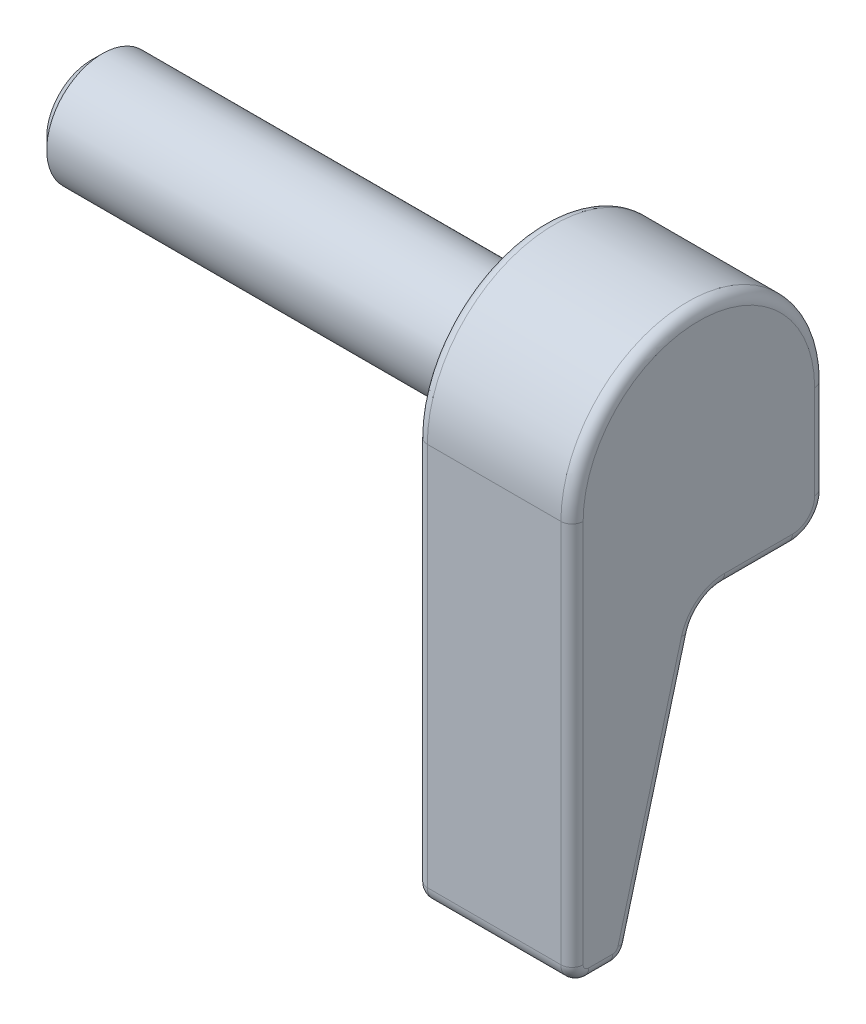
ISO-10303-21;
HEADER;
FILE_DESCRIPTION(('STEP AP214'),'2;1');
FILE_NAME('part.step','',(''),(''),'','','');
FILE_SCHEMA(('AUTOMOTIVE_DESIGN { 1 0 10303 214 1 1 1 1 }'));
ENDSEC;
DATA;
#1=APPLICATION_CONTEXT('core data for automotive mechanical design processes');
#2=APPLICATION_PROTOCOL_DEFINITION('international standard','automotive_design',2000,#1);
#3=PRODUCT_CONTEXT('',#1,'mechanical');
#4=PRODUCT('Part','Part','',(#3));
#5=PRODUCT_RELATED_PRODUCT_CATEGORY('part','',(#4));
#6=PRODUCT_DEFINITION_FORMATION('','',#4);
#7=PRODUCT_DEFINITION_CONTEXT('part definition',#1,'design');
#8=PRODUCT_DEFINITION('design','',#6,#7);
#9=PRODUCT_DEFINITION_SHAPE('','',#8);
#10=(LENGTH_UNIT() NAMED_UNIT(*) SI_UNIT(.MILLI.,.METRE.));
#11=(NAMED_UNIT(*) PLANE_ANGLE_UNIT() SI_UNIT($,.RADIAN.));
#12=(NAMED_UNIT(*) SI_UNIT($,.STERADIAN.) SOLID_ANGLE_UNIT());
#13=UNCERTAINTY_MEASURE_WITH_UNIT(LENGTH_MEASURE(1.E-05),#10,'distance_accuracy_value','');
#14=(GEOMETRIC_REPRESENTATION_CONTEXT(3) GLOBAL_UNCERTAINTY_ASSIGNED_CONTEXT((#13)) GLOBAL_UNIT_ASSIGNED_CONTEXT((#10,
#11,#12)) REPRESENTATION_CONTEXT('',''));
#15=CARTESIAN_POINT('',(0.,0.,0.));
#16=DIRECTION('',(0.,0.,1.));
#17=DIRECTION('',(1.,0.,0.));
#18=AXIS2_PLACEMENT_3D('',#15,#16,#17);
#19=CARTESIAN_POINT('',(40.,0.,0.));
#20=DIRECTION('',(-1.,0.,0.));
#21=DIRECTION('',(0.,0.,1.));
#22=AXIS2_PLACEMENT_3D('',#19,#20,#21);
#23=CYLINDRICAL_SURFACE('',#22,5.);
#24=CARTESIAN_POINT('',(39.75,0.,0.));
#25=DIRECTION('',(1.,0.,0.));
#26=DIRECTION('',(0.,0.,-1.));
#27=AXIS2_PLACEMENT_3D('',#24,#25,#26);
#28=CIRCLE('',#27,5.);
#29=CARTESIAN_POINT('',(39.75,0.,-5.));
#30=VERTEX_POINT('',#29);
#31=EDGE_CURVE('E11',#30,#30,#28,.F.);
#32=ORIENTED_EDGE('',*,*,#31,.T.);
#33=EDGE_LOOP('',(#32));
#34=FACE_BOUND('',#33,.T.);
#35=CARTESIAN_POINT('',(1.,0.,0.));
#36=DIRECTION('',(1.,0.,0.));
#37=DIRECTION('',(0.,0.,-1.));
#38=AXIS2_PLACEMENT_3D('',#35,#36,#37);
#39=CIRCLE('',#38,5.);
#40=CARTESIAN_POINT('',(1.,0.,-5.));
#41=VERTEX_POINT('',#40);
#42=EDGE_CURVE('E179',#41,#41,#39,.T.);
#43=ORIENTED_EDGE('',*,*,#42,.T.);
#44=EDGE_LOOP('',(#43));
#45=FACE_BOUND('',#44,.T.);
#46=ADVANCED_FACE('F31',(#34,#45),#23,.T.);
#47=CARTESIAN_POINT('',(0.,0.,0.));
#48=DIRECTION('',(1.,0.,0.));
#49=DIRECTION('',(0.,0.,-1.));
#50=AXIS2_PLACEMENT_3D('',#47,#48,#49);
#51=PLANE('',#50);
#52=CARTESIAN_POINT('',(0.,0.,0.));
#53=DIRECTION('',(1.,0.,0.));
#54=DIRECTION('',(0.,0.,-1.));
#55=AXIS2_PLACEMENT_3D('',#52,#53,#54);
#56=CIRCLE('',#55,3.99999999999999);
#57=CARTESIAN_POINT('',(0.,0.,-3.99999999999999));
#58=VERTEX_POINT('',#57);
#59=EDGE_CURVE('E333',#58,#58,#56,.F.);
#60=ORIENTED_EDGE('',*,*,#59,.T.);
#61=EDGE_LOOP('',(#60));
#62=FACE_BOUND('',#61,.T.);
#63=ADVANCED_FACE('F351',(#62),#51,.F.);
#64=CARTESIAN_POINT('',(40.,0.,-0.600000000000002));
#65=DIRECTION('',(1.,0.,0.));
#66=DIRECTION('',(0.,0.,-1.));
#67=AXIS2_PLACEMENT_3D('',#64,#65,#66);
#68=PLANE('',#67);
#69=CARTESIAN_POINT('',(40.,0.,0.));
#70=DIRECTION('',(1.,0.,0.));
#71=DIRECTION('',(0.,0.,-1.));
#72=AXIS2_PLACEMENT_3D('',#69,#70,#71);
#73=CIRCLE('',#72,5.24999999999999);
#74=CARTESIAN_POINT('',(40.,0.,-5.24999999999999));
#75=VERTEX_POINT('',#74);
#76=EDGE_CURVE('E39',#75,#75,#73,.T.);
#77=ORIENTED_EDGE('',*,*,#76,.T.);
#78=EDGE_LOOP('',(#77));
#79=FACE_BOUND('',#78,.T.);
#80=DIRECTION('',(0.,-1.,0.));
#81=VECTOR('',#80,1.);
#82=CARTESIAN_POINT('',(40.,0.,9.8));
#83=LINE('',#82,#81);
#84=CARTESIAN_POINT('',(40.,-34.5,9.8));
#85=VERTEX_POINT('',#84);
#86=CARTESIAN_POINT('',(40.,0.,9.8));
#87=VERTEX_POINT('',#86);
#88=EDGE_CURVE('E206',#85,#87,#83,.F.);
#89=ORIENTED_EDGE('',*,*,#88,.T.);
#90=CARTESIAN_POINT('',(40.,0.,-0.600000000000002));
#91=DIRECTION('',(1.,0.,0.));
#92=DIRECTION('',(0.,0.,-1.));
#93=AXIS2_PLACEMENT_3D('',#90,#91,#92);
#94=CIRCLE('',#93,10.4);
#95=CARTESIAN_POINT('',(40.,0.,-11.));
#96=VERTEX_POINT('',#95);
#97=EDGE_CURVE('E227',#87,#96,#94,.F.);
#98=ORIENTED_EDGE('',*,*,#97,.T.);
#99=DIRECTION('',(0.,1.,0.));
#100=VECTOR('',#99,1.);
#101=CARTESIAN_POINT('',(40.,0.,-11.));
#102=LINE('',#101,#100);
#103=CARTESIAN_POINT('',(40.,-8.4,-11.));
#104=VERTEX_POINT('',#103);
#105=EDGE_CURVE('E225',#96,#104,#102,.F.);
#106=ORIENTED_EDGE('',*,*,#105,.T.);
#107=CARTESIAN_POINT('',(40.,-8.4,-9.));
#108=DIRECTION('',(1.,0.,0.));
#109=DIRECTION('',(0.,0.,-1.));
#110=AXIS2_PLACEMENT_3D('',#107,#108,#109);
#111=CIRCLE('',#110,2.);
#112=CARTESIAN_POINT('',(40.,-10.4,-9.));
#113=VERTEX_POINT('',#112);
#114=EDGE_CURVE('E223',#104,#113,#111,.F.);
#115=ORIENTED_EDGE('',*,*,#114,.T.);
#116=DIRECTION('',(0.,0.,-1.));
#117=VECTOR('',#116,1.);
#118=CARTESIAN_POINT('',(40.,-10.4,-0.600000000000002));
#119=LINE('',#118,#117);
#120=CARTESIAN_POINT('',(40.,-10.4,-2.90121735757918));
#121=VERTEX_POINT('',#120);
#122=EDGE_CURVE('E221',#113,#121,#119,.F.);
#123=ORIENTED_EDGE('',*,*,#122,.T.);
#124=CARTESIAN_POINT('',(40.,-14.4,-2.90121735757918));
#125=DIRECTION('',(1.,0.,0.));
#126=DIRECTION('',(0.,0.,-1.));
#127=AXIS2_PLACEMENT_3D('',#124,#125,#126);
#128=CIRCLE('',#127,4.);
#129=CARTESIAN_POINT('',(40.,-13.3634857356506,0.962153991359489));
#130=VERTEX_POINT('',#129);
#131=EDGE_CURVE('E219',#121,#130,#128,.T.);
#132=ORIENTED_EDGE('',*,*,#131,.T.);
#133=DIRECTION('',(0.,0.965842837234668,-0.25912856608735));
#134=VECTOR('',#133,1.);
#135=CARTESIAN_POINT('',(40.,-0.506354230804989,-2.4873203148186));
#136=LINE('',#135,#134);
#137=CARTESIAN_POINT('',(40.,-34.6295642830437,6.66768726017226));
#138=VERTEX_POINT('',#137);
#139=EDGE_CURVE('E217',#130,#138,#136,.F.);
#140=ORIENTED_EDGE('',*,*,#139,.T.);
#141=CARTESIAN_POINT('',(40.,-34.5,7.15060867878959));
#142=DIRECTION('',(1.,0.,0.));
#143=DIRECTION('',(0.,0.,-1.));
#144=AXIS2_PLACEMENT_3D('',#141,#142,#143);
#145=CIRCLE('',#144,0.500000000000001);
#146=CARTESIAN_POINT('',(40.,-35.,7.15060867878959));
#147=VERTEX_POINT('',#146);
#148=EDGE_CURVE('E215',#138,#147,#145,.F.);
#149=ORIENTED_EDGE('',*,*,#148,.T.);
#150=DIRECTION('',(0.,0.,-1.));
#151=VECTOR('',#150,1.);
#152=CARTESIAN_POINT('',(40.,-35.,-0.600000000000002));
#153=LINE('',#152,#151);
#154=CARTESIAN_POINT('',(40.,-35.,9.3));
#155=VERTEX_POINT('',#154);
#156=EDGE_CURVE('E213',#147,#155,#153,.F.);
#157=ORIENTED_EDGE('',*,*,#156,.T.);
#158=CARTESIAN_POINT('',(40.,-34.5,9.3));
#159=DIRECTION('',(1.,0.,0.));
#160=DIRECTION('',(0.,0.,-1.));
#161=AXIS2_PLACEMENT_3D('',#158,#159,#160);
#162=CIRCLE('',#161,0.500000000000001);
#163=EDGE_CURVE('E211',#155,#85,#162,.F.);
#164=ORIENTED_EDGE('',*,*,#163,.T.);
#165=EDGE_LOOP('',(#89,#98,#106,#115,#123,#132,#140,#149,#157,#164));
#166=FACE_BOUND('',#165,.T.);
#167=ADVANCED_FACE('F338',(#79,#166),#68,.F.);
#168=CARTESIAN_POINT('',(54.,0.,-0.600000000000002));
#169=DIRECTION('',(-1.,0.,0.));
#170=DIRECTION('',(0.,0.,1.));
#171=AXIS2_PLACEMENT_3D('',#168,#169,#170);
#172=CYLINDRICAL_SURFACE('',#171,11.4);
#173=DIRECTION('',(-1.,0.,0.));
#174=VECTOR('',#173,1.);
#175=CARTESIAN_POINT('',(54.,0.,-12.));
#176=LINE('',#175,#174);
#177=CARTESIAN_POINT('',(53.,0.,-12.));
#178=VERTEX_POINT('',#177);
#179=CARTESIAN_POINT('',(41.,0.,-12.));
#180=VERTEX_POINT('',#179);
#181=EDGE_CURVE('E310',#178,#180,#176,.T.);
#182=ORIENTED_EDGE('',*,*,#181,.T.);
#183=CARTESIAN_POINT('',(41.,0.,-0.600000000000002));
#184=DIRECTION('',(1.,0.,0.));
#185=DIRECTION('',(0.,0.,-1.));
#186=AXIS2_PLACEMENT_3D('',#183,#184,#185);
#187=CIRCLE('',#186,11.4);
#188=CARTESIAN_POINT('',(41.,0.,10.8));
#189=VERTEX_POINT('',#188);
#190=EDGE_CURVE('E190',#180,#189,#187,.T.);
#191=ORIENTED_EDGE('',*,*,#190,.T.);
#192=DIRECTION('',(-1.,0.,0.));
#193=VECTOR('',#192,1.);
#194=CARTESIAN_POINT('',(54.,0.,10.8));
#195=LINE('',#194,#193);
#196=CARTESIAN_POINT('',(53.,0.,10.8));
#197=VERTEX_POINT('',#196);
#198=EDGE_CURVE('E172',#197,#189,#195,.T.);
#199=ORIENTED_EDGE('',*,*,#198,.F.);
#200=CARTESIAN_POINT('',(53.,0.,-0.600000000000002));
#201=DIRECTION('',(1.,0.,0.));
#202=DIRECTION('',(0.,0.,-1.));
#203=AXIS2_PLACEMENT_3D('',#200,#201,#202);
#204=CIRCLE('',#203,11.4);
#205=EDGE_CURVE('E187',#197,#178,#204,.F.);
#206=ORIENTED_EDGE('',*,*,#205,.T.);
#207=EDGE_LOOP('',(#182,#191,#199,#206));
#208=FACE_BOUND('',#207,.T.);
#209=ADVANCED_FACE('F185',(#208),#172,.T.);
#210=CARTESIAN_POINT('',(54.,0.,10.8));
#211=DIRECTION('',(0.,0.,-1.));
#212=DIRECTION('',(0.,1.,0.));
#213=AXIS2_PLACEMENT_3D('',#210,#211,#212);
#214=PLANE('',#213);
#215=DIRECTION('',(-1.,0.,0.));
#216=VECTOR('',#215,1.);
#217=CARTESIAN_POINT('',(54.,-34.5,10.8));
#218=LINE('',#217,#216);
#219=CARTESIAN_POINT('',(53.,-34.5,10.8));
#220=VERTEX_POINT('',#219);
#221=CARTESIAN_POINT('',(41.,-34.5,10.8));
#222=VERTEX_POINT('',#221);
#223=EDGE_CURVE('E174',#220,#222,#218,.T.);
#224=ORIENTED_EDGE('',*,*,#223,.F.);
#225=DIRECTION('',(0.,-1.,0.));
#226=VECTOR('',#225,1.);
#227=CARTESIAN_POINT('',(53.,0.,10.8));
#228=LINE('',#227,#226);
#229=EDGE_CURVE('E169',#220,#197,#228,.F.);
#230=ORIENTED_EDGE('',*,*,#229,.T.);
#231=ORIENTED_EDGE('',*,*,#198,.T.);
#232=DIRECTION('',(0.,-1.,0.));
#233=VECTOR('',#232,1.);
#234=CARTESIAN_POINT('',(41.,0.,10.8));
#235=LINE('',#234,#233);
#236=EDGE_CURVE('E180',#189,#222,#235,.T.);
#237=ORIENTED_EDGE('',*,*,#236,.T.);
#238=EDGE_LOOP('',(#224,#230,#231,#237));
#239=FACE_BOUND('',#238,.T.);
#240=ADVANCED_FACE('F171',(#239),#214,.F.);
#241=CARTESIAN_POINT('',(54.,-34.5,9.3));
#242=DIRECTION('',(-1.,0.,0.));
#243=DIRECTION('',(0.,0.,1.));
#244=AXIS2_PLACEMENT_3D('',#241,#242,#243);
#245=CYLINDRICAL_SURFACE('',#244,1.5);
#246=ORIENTED_EDGE('',*,*,#223,.T.);
#247=CARTESIAN_POINT('',(41.,-34.5,9.3));
#248=DIRECTION('',(1.,0.,0.));
#249=DIRECTION('',(0.,0.,-1.));
#250=AXIS2_PLACEMENT_3D('',#247,#248,#249);
#251=CIRCLE('',#250,1.5);
#252=CARTESIAN_POINT('',(41.,-36.,9.3));
#253=VERTEX_POINT('',#252);
#254=EDGE_CURVE('E261',#222,#253,#251,.T.);
#255=ORIENTED_EDGE('',*,*,#254,.T.);
#256=DIRECTION('',(-1.,0.,0.));
#257=VECTOR('',#256,1.);
#258=CARTESIAN_POINT('',(54.,-36.,9.3));
#259=LINE('',#258,#257);
#260=CARTESIAN_POINT('',(53.,-36.,9.3));
#261=VERTEX_POINT('',#260);
#262=EDGE_CURVE('E452',#261,#253,#259,.T.);
#263=ORIENTED_EDGE('',*,*,#262,.F.);
#264=CARTESIAN_POINT('',(53.,-34.5,9.3));
#265=DIRECTION('',(1.,0.,0.));
#266=DIRECTION('',(0.,0.,-1.));
#267=AXIS2_PLACEMENT_3D('',#264,#265,#266);
#268=CIRCLE('',#267,1.5);
#269=EDGE_CURVE('E259',#261,#220,#268,.F.);
#270=ORIENTED_EDGE('',*,*,#269,.T.);
#271=EDGE_LOOP('',(#246,#255,#263,#270));
#272=FACE_BOUND('',#271,.T.);
#273=ADVANCED_FACE('F457',(#272),#245,.T.);
#274=CARTESIAN_POINT('',(54.,-36.,9.3));
#275=DIRECTION('',(0.,1.,0.));
#276=DIRECTION('',(0.,0.,1.));
#277=AXIS2_PLACEMENT_3D('',#274,#275,#276);
#278=PLANE('',#277);
#279=ORIENTED_EDGE('',*,*,#262,.T.);
#280=DIRECTION('',(0.,0.,-1.));
#281=VECTOR('',#280,1.);
#282=CARTESIAN_POINT('',(41.,-36.,9.3));
#283=LINE('',#282,#281);
#284=CARTESIAN_POINT('',(41.,-36.,7.15060867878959));
#285=VERTEX_POINT('',#284);
#286=EDGE_CURVE('E257',#253,#285,#283,.T.);
#287=ORIENTED_EDGE('',*,*,#286,.T.);
#288=DIRECTION('',(-1.,0.,0.));
#289=VECTOR('',#288,1.);
#290=CARTESIAN_POINT('',(54.,-36.,7.15060867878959));
#291=LINE('',#290,#289);
#292=CARTESIAN_POINT('',(53.,-36.,7.15060867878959));
#293=VERTEX_POINT('',#292);
#294=EDGE_CURVE('E455',#293,#285,#291,.T.);
#295=ORIENTED_EDGE('',*,*,#294,.F.);
#296=DIRECTION('',(0.,0.,-1.));
#297=VECTOR('',#296,1.);
#298=CARTESIAN_POINT('',(53.,-36.,9.3));
#299=LINE('',#298,#297);
#300=EDGE_CURVE('E255',#293,#261,#299,.F.);
#301=ORIENTED_EDGE('',*,*,#300,.T.);
#302=EDGE_LOOP('',(#279,#287,#295,#301));
#303=FACE_BOUND('',#302,.T.);
#304=ADVANCED_FACE('F451',(#303),#278,.F.);
#305=CARTESIAN_POINT('',(54.,-34.5,7.15060867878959));
#306=DIRECTION('',(-1.,0.,0.));
#307=DIRECTION('',(0.,0.,1.));
#308=AXIS2_PLACEMENT_3D('',#305,#306,#307);
#309=CYLINDRICAL_SURFACE('',#308,1.5);
#310=ORIENTED_EDGE('',*,*,#294,.T.);
#311=CARTESIAN_POINT('',(41.,-34.5,7.15060867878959));
#312=DIRECTION('',(1.,0.,0.));
#313=DIRECTION('',(0.,0.,-1.));
#314=AXIS2_PLACEMENT_3D('',#311,#312,#313);
#315=CIRCLE('',#314,1.5);
#316=CARTESIAN_POINT('',(41.,-34.888692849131,5.70184442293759));
#317=VERTEX_POINT('',#316);
#318=EDGE_CURVE('E253',#285,#317,#315,.T.);
#319=ORIENTED_EDGE('',*,*,#318,.T.);
#320=DIRECTION('',(-1.,0.,0.));
#321=VECTOR('',#320,1.);
#322=CARTESIAN_POINT('',(54.,-34.888692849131,5.70184442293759));
#323=LINE('',#322,#321);
#324=CARTESIAN_POINT('',(53.,-34.888692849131,5.70184442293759));
#325=VERTEX_POINT('',#324);
#326=EDGE_CURVE('E460',#325,#317,#323,.T.);
#327=ORIENTED_EDGE('',*,*,#326,.F.);
#328=CARTESIAN_POINT('',(53.,-34.5,7.15060867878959));
#329=DIRECTION('',(1.,0.,0.));
#330=DIRECTION('',(0.,0.,-1.));
#331=AXIS2_PLACEMENT_3D('',#328,#329,#330);
#332=CIRCLE('',#331,1.5);
#333=EDGE_CURVE('E251',#325,#293,#332,.F.);
#334=ORIENTED_EDGE('',*,*,#333,.T.);
#335=EDGE_LOOP('',(#310,#319,#327,#334));
#336=FACE_BOUND('',#335,.T.);
#337=ADVANCED_FACE('F493',(#336),#309,.T.);
#338=CARTESIAN_POINT('',(54.,-34.888692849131,5.70184442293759));
#339=DIRECTION('',(0.,0.25912856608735,0.965842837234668));
#340=DIRECTION('',(0.,-0.965842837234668,0.25912856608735));
#341=AXIS2_PLACEMENT_3D('',#338,#339,#340);
#342=PLANE('',#341);
#343=ORIENTED_EDGE('',*,*,#326,.T.);
#344=DIRECTION('',(0.,0.965842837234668,-0.25912856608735));
#345=VECTOR('',#344,1.);
#346=CARTESIAN_POINT('',(41.,-34.888692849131,5.70184442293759));
#347=LINE('',#346,#345);
#348=CARTESIAN_POINT('',(41.,-13.622614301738,-0.00368884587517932));
#349=VERTEX_POINT('',#348);
#350=EDGE_CURVE('E249',#317,#349,#347,.T.);
#351=ORIENTED_EDGE('',*,*,#350,.T.);
#352=DIRECTION('',(-1.,0.,0.));
#353=VECTOR('',#352,1.);
#354=CARTESIAN_POINT('',(54.,-13.622614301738,-0.00368884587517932));
#355=LINE('',#354,#353);
#356=CARTESIAN_POINT('',(53.,-13.622614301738,-0.00368884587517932));
#357=VERTEX_POINT('',#356);
#358=EDGE_CURVE('E465',#357,#349,#355,.T.);
#359=ORIENTED_EDGE('',*,*,#358,.F.);
#360=DIRECTION('',(0.,0.965842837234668,-0.25912856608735));
#361=VECTOR('',#360,1.);
#362=CARTESIAN_POINT('',(53.,-34.888692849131,5.70184442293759));
#363=LINE('',#362,#361);
#364=EDGE_CURVE('E247',#357,#325,#363,.F.);
#365=ORIENTED_EDGE('',*,*,#364,.T.);
#366=EDGE_LOOP('',(#343,#351,#359,#365));
#367=FACE_BOUND('',#366,.T.);
#368=ADVANCED_FACE('F503',(#367),#342,.F.);
#369=CARTESIAN_POINT('',(54.,-14.4,-2.90121735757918));
#370=DIRECTION('',(-1.,0.,0.));
#371=DIRECTION('',(0.,0.,1.));
#372=AXIS2_PLACEMENT_3D('',#369,#370,#371);
#373=CYLINDRICAL_SURFACE('',#372,3.);
#374=ORIENTED_EDGE('',*,*,#358,.T.);
#375=CARTESIAN_POINT('',(41.,-14.4,-2.90121735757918));
#376=DIRECTION('',(1.,0.,0.));
#377=DIRECTION('',(0.,0.,-1.));
#378=AXIS2_PLACEMENT_3D('',#375,#376,#377);
#379=CIRCLE('',#378,3.);
#380=CARTESIAN_POINT('',(41.,-11.4,-2.90121735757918));
#381=VERTEX_POINT('',#380);
#382=EDGE_CURVE('E245',#349,#381,#379,.F.);
#383=ORIENTED_EDGE('',*,*,#382,.T.);
#384=DIRECTION('',(-1.,0.,0.));
#385=VECTOR('',#384,1.);
#386=CARTESIAN_POINT('',(54.,-11.4,-2.90121735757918));
#387=LINE('',#386,#385);
#388=CARTESIAN_POINT('',(53.,-11.4,-2.90121735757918));
#389=VERTEX_POINT('',#388);
#390=EDGE_CURVE('E468',#389,#381,#387,.T.);
#391=ORIENTED_EDGE('',*,*,#390,.F.);
#392=CARTESIAN_POINT('',(53.,-14.4,-2.90121735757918));
#393=DIRECTION('',(1.,0.,0.));
#394=DIRECTION('',(0.,0.,-1.));
#395=AXIS2_PLACEMENT_3D('',#392,#393,#394);
#396=CIRCLE('',#395,3.);
#397=EDGE_CURVE('E243',#389,#357,#396,.T.);
#398=ORIENTED_EDGE('',*,*,#397,.T.);
#399=EDGE_LOOP('',(#374,#383,#391,#398));
#400=FACE_BOUND('',#399,.T.);
#401=ADVANCED_FACE('F506',(#400),#373,.F.);
#402=CARTESIAN_POINT('',(54.,-11.4,-2.90121735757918));
#403=DIRECTION('',(0.,1.,0.));
#404=DIRECTION('',(0.,0.,1.));
#405=AXIS2_PLACEMENT_3D('',#402,#403,#404);
#406=PLANE('',#405);
#407=ORIENTED_EDGE('',*,*,#390,.T.);
#408=DIRECTION('',(0.,0.,-1.));
#409=VECTOR('',#408,1.);
#410=CARTESIAN_POINT('',(41.,-11.4,-2.90121735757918));
#411=LINE('',#410,#409);
#412=CARTESIAN_POINT('',(41.,-11.4,-9.));
#413=VERTEX_POINT('',#412);
#414=EDGE_CURVE('E241',#381,#413,#411,.T.);
#415=ORIENTED_EDGE('',*,*,#414,.T.);
#416=DIRECTION('',(-1.,0.,0.));
#417=VECTOR('',#416,1.);
#418=CARTESIAN_POINT('',(54.,-11.4,-9.));
#419=LINE('',#418,#417);
#420=CARTESIAN_POINT('',(53.,-11.4,-9.));
#421=VERTEX_POINT('',#420);
#422=EDGE_CURVE('E471',#421,#413,#419,.T.);
#423=ORIENTED_EDGE('',*,*,#422,.F.);
#424=DIRECTION('',(0.,0.,-1.));
#425=VECTOR('',#424,1.);
#426=CARTESIAN_POINT('',(53.,-11.4,-2.90121735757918));
#427=LINE('',#426,#425);
#428=EDGE_CURVE('E239',#421,#389,#427,.F.);
#429=ORIENTED_EDGE('',*,*,#428,.T.);
#430=EDGE_LOOP('',(#407,#415,#423,#429));
#431=FACE_BOUND('',#430,.T.);
#432=ADVANCED_FACE('F530',(#431),#406,.F.);
#433=CARTESIAN_POINT('',(54.,-8.4,-9.));
#434=DIRECTION('',(-1.,0.,0.));
#435=DIRECTION('',(0.,0.,1.));
#436=AXIS2_PLACEMENT_3D('',#433,#434,#435);
#437=CYLINDRICAL_SURFACE('',#436,3.);
#438=ORIENTED_EDGE('',*,*,#422,.T.);
#439=CARTESIAN_POINT('',(41.,-8.4,-9.));
#440=DIRECTION('',(1.,0.,0.));
#441=DIRECTION('',(0.,0.,-1.));
#442=AXIS2_PLACEMENT_3D('',#439,#440,#441);
#443=CIRCLE('',#442,3.);
#444=CARTESIAN_POINT('',(41.,-8.4,-12.));
#445=VERTEX_POINT('',#444);
#446=EDGE_CURVE('E237',#413,#445,#443,.T.);
#447=ORIENTED_EDGE('',*,*,#446,.T.);
#448=DIRECTION('',(-1.,0.,0.));
#449=VECTOR('',#448,1.);
#450=CARTESIAN_POINT('',(54.,-8.4,-12.));
#451=LINE('',#450,#449);
#452=CARTESIAN_POINT('',(53.,-8.4,-12.));
#453=VERTEX_POINT('',#452);
#454=EDGE_CURVE('E474',#453,#445,#451,.T.);
#455=ORIENTED_EDGE('',*,*,#454,.F.);
#456=CARTESIAN_POINT('',(53.,-8.4,-9.));
#457=DIRECTION('',(1.,0.,0.));
#458=DIRECTION('',(0.,0.,-1.));
#459=AXIS2_PLACEMENT_3D('',#456,#457,#458);
#460=CIRCLE('',#459,3.);
#461=EDGE_CURVE('E235',#453,#421,#460,.F.);
#462=ORIENTED_EDGE('',*,*,#461,.T.);
#463=EDGE_LOOP('',(#438,#447,#455,#462));
#464=FACE_BOUND('',#463,.T.);
#465=ADVANCED_FACE('F523',(#464),#437,.T.);
#466=CARTESIAN_POINT('',(54.,-8.4,-12.));
#467=DIRECTION('',(0.,0.,1.));
#468=DIRECTION('',(0.,-1.,0.));
#469=AXIS2_PLACEMENT_3D('',#466,#467,#468);
#470=PLANE('',#469);
#471=ORIENTED_EDGE('',*,*,#454,.T.);
#472=DIRECTION('',(0.,1.,0.));
#473=VECTOR('',#472,1.);
#474=CARTESIAN_POINT('',(41.,-8.4,-12.));
#475=LINE('',#474,#473);
#476=EDGE_CURVE('E233',#445,#180,#475,.T.);
#477=ORIENTED_EDGE('',*,*,#476,.T.);
#478=ORIENTED_EDGE('',*,*,#181,.F.);
#479=DIRECTION('',(0.,1.,0.));
#480=VECTOR('',#479,1.);
#481=CARTESIAN_POINT('',(53.,-8.4,-12.));
#482=LINE('',#481,#480);
#483=EDGE_CURVE('E230',#178,#453,#482,.F.);
#484=ORIENTED_EDGE('',*,*,#483,.T.);
#485=EDGE_LOOP('',(#471,#477,#478,#484));
#486=FACE_BOUND('',#485,.T.);
#487=ADVANCED_FACE('F518',(#486),#470,.F.);
#488=CARTESIAN_POINT('',(54.,0.,-0.600000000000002));
#489=DIRECTION('',(1.,0.,0.));
#490=DIRECTION('',(0.,0.,-1.));
#491=AXIS2_PLACEMENT_3D('',#488,#489,#490);
#492=PLANE('',#491);
#493=CARTESIAN_POINT('',(54.,-8.4,-9.));
#494=DIRECTION('',(1.,0.,0.));
#495=DIRECTION('',(0.,0.,-1.));
#496=AXIS2_PLACEMENT_3D('',#493,#494,#495);
#497=CIRCLE('',#496,2.);
#498=CARTESIAN_POINT('',(54.,-10.4,-9.));
#499=VERTEX_POINT('',#498);
#500=CARTESIAN_POINT('',(54.,-8.4,-11.));
#501=VERTEX_POINT('',#500);
#502=EDGE_CURVE('E46',#499,#501,#497,.T.);
#503=ORIENTED_EDGE('',*,*,#502,.T.);
#504=DIRECTION('',(0.,1.,0.));
#505=VECTOR('',#504,1.);
#506=CARTESIAN_POINT('',(54.,0.,-11.));
#507=LINE('',#506,#505);
#508=CARTESIAN_POINT('',(54.,0.,-11.));
#509=VERTEX_POINT('',#508);
#510=EDGE_CURVE('E278',#501,#509,#507,.T.);
#511=ORIENTED_EDGE('',*,*,#510,.T.);
#512=CARTESIAN_POINT('',(54.,0.,-0.600000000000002));
#513=DIRECTION('',(1.,0.,0.));
#514=DIRECTION('',(0.,0.,-1.));
#515=AXIS2_PLACEMENT_3D('',#512,#513,#514);
#516=CIRCLE('',#515,10.4);
#517=CARTESIAN_POINT('',(54.,0.,9.8));
#518=VERTEX_POINT('',#517);
#519=EDGE_CURVE('E263',#509,#518,#516,.T.);
#520=ORIENTED_EDGE('',*,*,#519,.T.);
#521=DIRECTION('',(0.,-1.,0.));
#522=VECTOR('',#521,1.);
#523=CARTESIAN_POINT('',(54.,-34.5,9.8));
#524=LINE('',#523,#522);
#525=CARTESIAN_POINT('',(54.,-34.5,9.8));
#526=VERTEX_POINT('',#525);
#527=EDGE_CURVE('E196',#518,#526,#524,.T.);
#528=ORIENTED_EDGE('',*,*,#527,.T.);
#529=CARTESIAN_POINT('',(54.,-34.5,9.3));
#530=DIRECTION('',(1.,0.,0.));
#531=DIRECTION('',(0.,0.,-1.));
#532=AXIS2_PLACEMENT_3D('',#529,#530,#531);
#533=CIRCLE('',#532,0.500000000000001);
#534=CARTESIAN_POINT('',(54.,-35.,9.3));
#535=VERTEX_POINT('',#534);
#536=EDGE_CURVE('E266',#526,#535,#533,.T.);
#537=ORIENTED_EDGE('',*,*,#536,.T.);
#538=DIRECTION('',(0.,0.,-1.));
#539=VECTOR('',#538,1.);
#540=CARTESIAN_POINT('',(54.,-35.,7.15060867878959));
#541=LINE('',#540,#539);
#542=CARTESIAN_POINT('',(54.,-35.,7.15060867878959));
#543=VERTEX_POINT('',#542);
#544=EDGE_CURVE('E268',#535,#543,#541,.T.);
#545=ORIENTED_EDGE('',*,*,#544,.T.);
#546=CARTESIAN_POINT('',(54.,-34.5,7.15060867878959));
#547=DIRECTION('',(1.,0.,0.));
#548=DIRECTION('',(0.,0.,-1.));
#549=AXIS2_PLACEMENT_3D('',#546,#547,#548);
#550=CIRCLE('',#549,0.500000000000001);
#551=CARTESIAN_POINT('',(54.,-34.6295642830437,6.66768726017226));
#552=VERTEX_POINT('',#551);
#553=EDGE_CURVE('E270',#543,#552,#550,.T.);
#554=ORIENTED_EDGE('',*,*,#553,.T.);
#555=DIRECTION('',(0.,0.965842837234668,-0.25912856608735));
#556=VECTOR('',#555,1.);
#557=CARTESIAN_POINT('',(54.,-13.3634857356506,0.962153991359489));
#558=LINE('',#557,#556);
#559=CARTESIAN_POINT('',(54.,-13.3634857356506,0.962153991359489));
#560=VERTEX_POINT('',#559);
#561=EDGE_CURVE('E272',#552,#560,#558,.T.);
#562=ORIENTED_EDGE('',*,*,#561,.T.);
#563=CARTESIAN_POINT('',(54.,-14.4,-2.90121735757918));
#564=DIRECTION('',(1.,0.,0.));
#565=DIRECTION('',(0.,0.,-1.));
#566=AXIS2_PLACEMENT_3D('',#563,#564,#565);
#567=CIRCLE('',#566,4.);
#568=CARTESIAN_POINT('',(54.,-10.4,-2.90121735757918));
#569=VERTEX_POINT('',#568);
#570=EDGE_CURVE('E274',#560,#569,#567,.F.);
#571=ORIENTED_EDGE('',*,*,#570,.T.);
#572=DIRECTION('',(0.,0.,-1.));
#573=VECTOR('',#572,1.);
#574=CARTESIAN_POINT('',(54.,-10.4,-9.));
#575=LINE('',#574,#573);
#576=EDGE_CURVE('E51',#569,#499,#575,.T.);
#577=ORIENTED_EDGE('',*,*,#576,.T.);
#578=EDGE_LOOP('',(#503,#511,#520,#528,#537,#545,#554,#562,#571,#577));
#579=FACE_BOUND('',#578,.T.);
#580=ADVANCED_FACE('F402',(#579),#492,.T.);
#581=CARTESIAN_POINT('',(41.,-34.6295642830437,6.66768726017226));
#582=DIRECTION('',(0.,0.965842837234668,-0.25912856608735));
#583=DIRECTION('',(0.,0.25912856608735,0.965842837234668));
#584=AXIS2_PLACEMENT_3D('',#581,#582,#583);
#585=CYLINDRICAL_SURFACE('',#584,1.);
#586=CARTESIAN_POINT('',(41.,-34.6295642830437,6.66768726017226));
#587=DIRECTION('',(0.,-0.965842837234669,0.259128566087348));
#588=DIRECTION('',(0.,-0.259128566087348,-0.965842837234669));
#589=AXIS2_PLACEMENT_3D('',#586,#587,#588);
#590=CIRCLE('',#589,1.);
#591=EDGE_CURVE('E304',#138,#317,#590,.T.);
#592=ORIENTED_EDGE('',*,*,#591,.F.);
#593=ORIENTED_EDGE('',*,*,#139,.F.);
#594=CARTESIAN_POINT('',(41.,-13.3634857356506,0.962153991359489));
#595=DIRECTION('',(0.,0.965842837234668,-0.25912856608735));
#596=DIRECTION('',(0.,0.25912856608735,0.965842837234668));
#597=AXIS2_PLACEMENT_3D('',#594,#595,#596);
#598=CIRCLE('',#597,1.);
#599=EDGE_CURVE('E307',#349,#130,#598,.T.);
#600=ORIENTED_EDGE('',*,*,#599,.F.);
#601=ORIENTED_EDGE('',*,*,#350,.F.);
#602=EDGE_LOOP('',(#592,#593,#600,#601));
#603=FACE_BOUND('',#602,.T.);
#604=ADVANCED_FACE('F398',(#603),#585,.T.);
#605=CARTESIAN_POINT('',(41.,-14.4,-2.90121735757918));
#606=DIRECTION('',(1.,0.,0.));
#607=DIRECTION('',(0.,0.,-1.));
#608=AXIS2_PLACEMENT_3D('',#605,#606,#607);
#609=TOROIDAL_SURFACE('',#608,4.,1.);
#610=ORIENTED_EDGE('',*,*,#599,.T.);
#611=ORIENTED_EDGE('',*,*,#131,.F.);
#612=CARTESIAN_POINT('',(41.,-10.4,-2.90121735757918));
#613=DIRECTION('',(0.,0.,-1.));
#614=DIRECTION('',(-1.,0.,0.));
#615=AXIS2_PLACEMENT_3D('',#612,#613,#614);
#616=CIRCLE('',#615,1.);
#617=EDGE_CURVE('E301',#381,#121,#616,.T.);
#618=ORIENTED_EDGE('',*,*,#617,.F.);
#619=ORIENTED_EDGE('',*,*,#382,.F.);
#620=EDGE_LOOP('',(#610,#611,#618,#619));
#621=FACE_BOUND('',#620,.T.);
#622=ADVANCED_FACE('F394',(#621),#609,.T.);
#623=CARTESIAN_POINT('',(41.,-34.5,7.15060867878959));
#624=DIRECTION('',(1.,0.,0.));
#625=DIRECTION('',(0.,0.,-1.));
#626=AXIS2_PLACEMENT_3D('',#623,#624,#625);
#627=DEGENERATE_TOROIDAL_SURFACE('',#626,0.500000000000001,1.,.T.);
#628=ORIENTED_EDGE('',*,*,#591,.T.);
#629=ORIENTED_EDGE('',*,*,#318,.F.);
#630=CARTESIAN_POINT('',(41.,-35.,7.15060867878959));
#631=DIRECTION('',(0.,0.,1.));
#632=DIRECTION('',(1.,0.,0.));
#633=AXIS2_PLACEMENT_3D('',#630,#631,#632);
#634=CIRCLE('',#633,1.);
#635=EDGE_CURVE('E298',#147,#285,#634,.T.);
#636=ORIENTED_EDGE('',*,*,#635,.F.);
#637=ORIENTED_EDGE('',*,*,#148,.F.);
#638=EDGE_LOOP('',(#628,#629,#636,#637));
#639=FACE_BOUND('',#638,.T.);
#640=ADVANCED_FACE('F390',(#639),#627,.T.);
#641=CARTESIAN_POINT('',(41.,-10.4,-2.90121735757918));
#642=DIRECTION('',(0.,0.,-1.));
#643=DIRECTION('',(-1.,0.,0.));
#644=AXIS2_PLACEMENT_3D('',#641,#642,#643);
#645=CYLINDRICAL_SURFACE('',#644,1.);
#646=ORIENTED_EDGE('',*,*,#617,.T.);
#647=ORIENTED_EDGE('',*,*,#122,.F.);
#648=CARTESIAN_POINT('',(41.,-10.4,-9.));
#649=DIRECTION('',(0.,0.,-1.));
#650=DIRECTION('',(-1.,0.,0.));
#651=AXIS2_PLACEMENT_3D('',#648,#649,#650);
#652=CIRCLE('',#651,1.);
#653=EDGE_CURVE('E295',#413,#113,#652,.T.);
#654=ORIENTED_EDGE('',*,*,#653,.F.);
#655=ORIENTED_EDGE('',*,*,#414,.F.);
#656=EDGE_LOOP('',(#646,#647,#654,#655));
#657=FACE_BOUND('',#656,.T.);
#658=ADVANCED_FACE('F386',(#657),#645,.T.);
#659=CARTESIAN_POINT('',(41.,-35.,9.3));
#660=DIRECTION('',(0.,0.,-1.));
#661=DIRECTION('',(-1.,0.,0.));
#662=AXIS2_PLACEMENT_3D('',#659,#660,#661);
#663=CYLINDRICAL_SURFACE('',#662,1.);
#664=ORIENTED_EDGE('',*,*,#635,.T.);
#665=ORIENTED_EDGE('',*,*,#286,.F.);
#666=CARTESIAN_POINT('',(41.,-35.,9.3));
#667=DIRECTION('',(0.,0.,1.));
#668=DIRECTION('',(1.,0.,0.));
#669=AXIS2_PLACEMENT_3D('',#666,#667,#668);
#670=CIRCLE('',#669,1.);
#671=EDGE_CURVE('E292',#155,#253,#670,.T.);
#672=ORIENTED_EDGE('',*,*,#671,.F.);
#673=ORIENTED_EDGE('',*,*,#156,.F.);
#674=EDGE_LOOP('',(#664,#665,#672,#673));
#675=FACE_BOUND('',#674,.T.);
#676=ADVANCED_FACE('F382',(#675),#663,.T.);
#677=CARTESIAN_POINT('',(41.,-8.4,-9.));
#678=DIRECTION('',(1.,0.,0.));
#679=DIRECTION('',(0.,0.,-1.));
#680=AXIS2_PLACEMENT_3D('',#677,#678,#679);
#681=TOROIDAL_SURFACE('',#680,2.,1.);
#682=ORIENTED_EDGE('',*,*,#653,.T.);
#683=ORIENTED_EDGE('',*,*,#114,.F.);
#684=CARTESIAN_POINT('',(41.,-8.4,-11.));
#685=DIRECTION('',(0.,1.,0.));
#686=DIRECTION('',(0.,0.,1.));
#687=AXIS2_PLACEMENT_3D('',#684,#685,#686);
#688=CIRCLE('',#687,1.);
#689=EDGE_CURVE('E289',#445,#104,#688,.T.);
#690=ORIENTED_EDGE('',*,*,#689,.F.);
#691=ORIENTED_EDGE('',*,*,#446,.F.);
#692=EDGE_LOOP('',(#682,#683,#690,#691));
#693=FACE_BOUND('',#692,.T.);
#694=ADVANCED_FACE('F378',(#693),#681,.T.);
#695=CARTESIAN_POINT('',(41.,-34.5,9.3));
#696=DIRECTION('',(1.,0.,0.));
#697=DIRECTION('',(0.,0.,-1.));
#698=AXIS2_PLACEMENT_3D('',#695,#696,#697);
#699=DEGENERATE_TOROIDAL_SURFACE('',#698,0.500000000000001,1.,.T.);
#700=ORIENTED_EDGE('',*,*,#671,.T.);
#701=ORIENTED_EDGE('',*,*,#254,.F.);
#702=CARTESIAN_POINT('',(41.,-34.5,9.8));
#703=DIRECTION('',(0.,1.,0.));
#704=DIRECTION('',(0.,0.,1.));
#705=AXIS2_PLACEMENT_3D('',#702,#703,#704);
#706=CIRCLE('',#705,1.);
#707=EDGE_CURVE('E286',#85,#222,#706,.T.);
#708=ORIENTED_EDGE('',*,*,#707,.F.);
#709=ORIENTED_EDGE('',*,*,#163,.F.);
#710=EDGE_LOOP('',(#700,#701,#708,#709));
#711=FACE_BOUND('',#710,.T.);
#712=ADVANCED_FACE('F374',(#711),#699,.T.);
#713=CARTESIAN_POINT('',(41.,-8.4,-11.));
#714=DIRECTION('',(0.,1.,0.));
#715=DIRECTION('',(0.,0.,1.));
#716=AXIS2_PLACEMENT_3D('',#713,#714,#715);
#717=CYLINDRICAL_SURFACE('',#716,1.);
#718=ORIENTED_EDGE('',*,*,#689,.T.);
#719=ORIENTED_EDGE('',*,*,#105,.F.);
#720=CARTESIAN_POINT('',(41.,0.,-11.));
#721=DIRECTION('',(0.,1.,0.));
#722=DIRECTION('',(0.,0.,1.));
#723=AXIS2_PLACEMENT_3D('',#720,#721,#722);
#724=CIRCLE('',#723,1.);
#725=EDGE_CURVE('E283',#180,#96,#724,.T.);
#726=ORIENTED_EDGE('',*,*,#725,.F.);
#727=ORIENTED_EDGE('',*,*,#476,.F.);
#728=EDGE_LOOP('',(#718,#719,#726,#727));
#729=FACE_BOUND('',#728,.T.);
#730=ADVANCED_FACE('F370',(#729),#717,.T.);
#731=CARTESIAN_POINT('',(41.,0.,9.8));
#732=DIRECTION('',(0.,-1.,0.));
#733=DIRECTION('',(0.,0.,-1.));
#734=AXIS2_PLACEMENT_3D('',#731,#732,#733);
#735=CYLINDRICAL_SURFACE('',#734,1.);
#736=ORIENTED_EDGE('',*,*,#707,.T.);
#737=ORIENTED_EDGE('',*,*,#236,.F.);
#738=CARTESIAN_POINT('',(41.,0.,9.8));
#739=DIRECTION('',(0.,1.,0.));
#740=DIRECTION('',(0.,0.,1.));
#741=AXIS2_PLACEMENT_3D('',#738,#739,#740);
#742=CIRCLE('',#741,1.);
#743=EDGE_CURVE('E281',#87,#189,#742,.T.);
#744=ORIENTED_EDGE('',*,*,#743,.F.);
#745=ORIENTED_EDGE('',*,*,#88,.F.);
#746=EDGE_LOOP('',(#736,#737,#744,#745));
#747=FACE_BOUND('',#746,.T.);
#748=ADVANCED_FACE('F366',(#747),#735,.T.);
#749=CARTESIAN_POINT('',(41.,0.,-0.600000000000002));
#750=DIRECTION('',(1.,0.,0.));
#751=DIRECTION('',(0.,0.,-1.));
#752=AXIS2_PLACEMENT_3D('',#749,#750,#751);
#753=TOROIDAL_SURFACE('',#752,10.4,1.);
#754=ORIENTED_EDGE('',*,*,#725,.T.);
#755=ORIENTED_EDGE('',*,*,#97,.F.);
#756=ORIENTED_EDGE('',*,*,#743,.T.);
#757=ORIENTED_EDGE('',*,*,#190,.F.);
#758=EDGE_LOOP('',(#754,#755,#756,#757));
#759=FACE_BOUND('',#758,.T.);
#760=ADVANCED_FACE('F362',(#759),#753,.T.);
#761=CARTESIAN_POINT('',(53.,-34.5,7.15060867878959));
#762=DIRECTION('',(1.,0.,0.));
#763=DIRECTION('',(0.,0.,-1.));
#764=AXIS2_PLACEMENT_3D('',#761,#762,#763);
#765=DEGENERATE_TOROIDAL_SURFACE('',#764,0.500000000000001,1.,.T.);
#766=CARTESIAN_POINT('',(53.,-35.,7.15060867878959));
#767=DIRECTION('',(0.,0.,1.));
#768=DIRECTION('',(1.,0.,0.));
#769=AXIS2_PLACEMENT_3D('',#766,#767,#768);
#770=CIRCLE('',#769,1.);
#771=EDGE_CURVE('E326',#293,#543,#770,.T.);
#772=ORIENTED_EDGE('',*,*,#771,.F.);
#773=ORIENTED_EDGE('',*,*,#333,.F.);
#774=CARTESIAN_POINT('',(53.,-34.6295642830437,6.66768726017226));
#775=DIRECTION('',(0.,0.965842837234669,-0.259128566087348));
#776=DIRECTION('',(0.,0.259128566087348,0.965842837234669));
#777=AXIS2_PLACEMENT_3D('',#774,#775,#776);
#778=CIRCLE('',#777,1.);
#779=EDGE_CURVE('E284',#552,#325,#778,.T.);
#780=ORIENTED_EDGE('',*,*,#779,.F.);
#781=ORIENTED_EDGE('',*,*,#553,.F.);
#782=EDGE_LOOP('',(#772,#773,#780,#781));
#783=FACE_BOUND('',#782,.T.);
#784=ADVANCED_FACE('F365',(#783),#765,.T.);
#785=CARTESIAN_POINT('',(53.,-0.506354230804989,-2.4873203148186));
#786=DIRECTION('',(0.,-0.965842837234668,0.25912856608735));
#787=DIRECTION('',(0.,-0.25912856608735,-0.965842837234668));
#788=AXIS2_PLACEMENT_3D('',#785,#786,#787);
#789=CYLINDRICAL_SURFACE('',#788,1.);
#790=ORIENTED_EDGE('',*,*,#779,.T.);
#791=ORIENTED_EDGE('',*,*,#364,.F.);
#792=CARTESIAN_POINT('',(53.,-13.3634857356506,0.962153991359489));
#793=DIRECTION('',(0.,0.965842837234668,-0.25912856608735));
#794=DIRECTION('',(0.,0.25912856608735,0.965842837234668));
#795=AXIS2_PLACEMENT_3D('',#792,#793,#794);
#796=CIRCLE('',#795,1.);
#797=EDGE_CURVE('E323',#560,#357,#796,.T.);
#798=ORIENTED_EDGE('',*,*,#797,.F.);
#799=ORIENTED_EDGE('',*,*,#561,.F.);
#800=EDGE_LOOP('',(#790,#791,#798,#799));
#801=FACE_BOUND('',#800,.T.);
#802=ADVANCED_FACE('F430',(#801),#789,.T.);
#803=CARTESIAN_POINT('',(53.,-35.,-0.600000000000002));
#804=DIRECTION('',(0.,0.,1.));
#805=DIRECTION('',(1.,0.,0.));
#806=AXIS2_PLACEMENT_3D('',#803,#804,#805);
#807=CYLINDRICAL_SURFACE('',#806,1.);
#808=ORIENTED_EDGE('',*,*,#771,.T.);
#809=ORIENTED_EDGE('',*,*,#544,.F.);
#810=CARTESIAN_POINT('',(53.,-35.,9.3));
#811=DIRECTION('',(0.,0.,1.));
#812=DIRECTION('',(1.,0.,0.));
#813=AXIS2_PLACEMENT_3D('',#810,#811,#812);
#814=CIRCLE('',#813,1.);
#815=EDGE_CURVE('E320',#261,#535,#814,.T.);
#816=ORIENTED_EDGE('',*,*,#815,.F.);
#817=ORIENTED_EDGE('',*,*,#300,.F.);
#818=EDGE_LOOP('',(#808,#809,#816,#817));
#819=FACE_BOUND('',#818,.T.);
#820=ADVANCED_FACE('F426',(#819),#807,.T.);
#821=CARTESIAN_POINT('',(53.,-14.4,-2.90121735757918));
#822=DIRECTION('',(1.,0.,0.));
#823=DIRECTION('',(0.,0.,-1.));
#824=AXIS2_PLACEMENT_3D('',#821,#822,#823);
#825=TOROIDAL_SURFACE('',#824,4.,1.);
#826=ORIENTED_EDGE('',*,*,#797,.T.);
#827=ORIENTED_EDGE('',*,*,#397,.F.);
#828=CARTESIAN_POINT('',(53.,-10.4,-2.90121735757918));
#829=DIRECTION('',(0.,0.,-1.));
#830=DIRECTION('',(-1.,0.,0.));
#831=AXIS2_PLACEMENT_3D('',#828,#829,#830);
#832=CIRCLE('',#831,1.);
#833=EDGE_CURVE('E317',#569,#389,#832,.T.);
#834=ORIENTED_EDGE('',*,*,#833,.F.);
#835=ORIENTED_EDGE('',*,*,#570,.F.);
#836=EDGE_LOOP('',(#826,#827,#834,#835));
#837=FACE_BOUND('',#836,.T.);
#838=ADVANCED_FACE('F422',(#837),#825,.T.);
#839=CARTESIAN_POINT('',(53.,-34.5,9.3));
#840=DIRECTION('',(1.,0.,0.));
#841=DIRECTION('',(0.,0.,-1.));
#842=AXIS2_PLACEMENT_3D('',#839,#840,#841);
#843=DEGENERATE_TOROIDAL_SURFACE('',#842,0.500000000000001,1.,.T.);
#844=ORIENTED_EDGE('',*,*,#815,.T.);
#845=ORIENTED_EDGE('',*,*,#536,.F.);
#846=CARTESIAN_POINT('',(53.,-34.5,9.8));
#847=DIRECTION('',(0.,1.,0.));
#848=DIRECTION('',(0.,0.,1.));
#849=AXIS2_PLACEMENT_3D('',#846,#847,#848);
#850=CIRCLE('',#849,1.);
#851=EDGE_CURVE('E315',#220,#526,#850,.T.);
#852=ORIENTED_EDGE('',*,*,#851,.F.);
#853=ORIENTED_EDGE('',*,*,#269,.F.);
#854=EDGE_LOOP('',(#844,#845,#852,#853));
#855=FACE_BOUND('',#854,.T.);
#856=ADVANCED_FACE('F418',(#855),#843,.T.);
#857=CARTESIAN_POINT('',(53.,-10.4,-0.600000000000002));
#858=DIRECTION('',(0.,0.,1.));
#859=DIRECTION('',(1.,0.,0.));
#860=AXIS2_PLACEMENT_3D('',#857,#858,#859);
#861=CYLINDRICAL_SURFACE('',#860,1.);
#862=ORIENTED_EDGE('',*,*,#833,.T.);
#863=ORIENTED_EDGE('',*,*,#428,.F.);
#864=CARTESIAN_POINT('',(53.,-10.4,-9.));
#865=DIRECTION('',(0.,0.,-1.));
#866=DIRECTION('',(-1.,0.,0.));
#867=AXIS2_PLACEMENT_3D('',#864,#865,#866);
#868=CIRCLE('',#867,1.);
#869=EDGE_CURVE('E199',#499,#421,#868,.T.);
#870=ORIENTED_EDGE('',*,*,#869,.F.);
#871=ORIENTED_EDGE('',*,*,#576,.F.);
#872=EDGE_LOOP('',(#862,#863,#870,#871));
#873=FACE_BOUND('',#872,.T.);
#874=ADVANCED_FACE('F415',(#873),#861,.T.);
#875=CARTESIAN_POINT('',(53.,0.,9.8));
#876=DIRECTION('',(0.,1.,0.));
#877=DIRECTION('',(0.,0.,1.));
#878=AXIS2_PLACEMENT_3D('',#875,#876,#877);
#879=CYLINDRICAL_SURFACE('',#878,1.);
#880=ORIENTED_EDGE('',*,*,#851,.T.);
#881=ORIENTED_EDGE('',*,*,#527,.F.);
#882=CARTESIAN_POINT('',(53.,0.,9.8));
#883=DIRECTION('',(0.,1.,0.));
#884=DIRECTION('',(0.,0.,1.));
#885=AXIS2_PLACEMENT_3D('',#882,#883,#884);
#886=CIRCLE('',#885,1.);
#887=EDGE_CURVE('E194',#197,#518,#886,.T.);
#888=ORIENTED_EDGE('',*,*,#887,.F.);
#889=ORIENTED_EDGE('',*,*,#229,.F.);
#890=EDGE_LOOP('',(#880,#881,#888,#889));
#891=FACE_BOUND('',#890,.T.);
#892=ADVANCED_FACE('F195',(#891),#879,.T.);
#893=CARTESIAN_POINT('',(53.,-8.4,-9.));
#894=DIRECTION('',(1.,0.,0.));
#895=DIRECTION('',(0.,0.,-1.));
#896=AXIS2_PLACEMENT_3D('',#893,#894,#895);
#897=TOROIDAL_SURFACE('',#896,2.,1.);
#898=ORIENTED_EDGE('',*,*,#869,.T.);
#899=ORIENTED_EDGE('',*,*,#461,.F.);
#900=CARTESIAN_POINT('',(53.,-8.4,-11.));
#901=DIRECTION('',(0.,1.,0.));
#902=DIRECTION('',(0.,0.,1.));
#903=AXIS2_PLACEMENT_3D('',#900,#901,#902);
#904=CIRCLE('',#903,1.);
#905=EDGE_CURVE('E200',#501,#453,#904,.T.);
#906=ORIENTED_EDGE('',*,*,#905,.F.);
#907=ORIENTED_EDGE('',*,*,#502,.F.);
#908=EDGE_LOOP('',(#898,#899,#906,#907));
#909=FACE_BOUND('',#908,.T.);
#910=ADVANCED_FACE('F409',(#909),#897,.T.);
#911=CARTESIAN_POINT('',(53.,0.,-0.600000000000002));
#912=DIRECTION('',(1.,0.,0.));
#913=DIRECTION('',(0.,0.,-1.));
#914=AXIS2_PLACEMENT_3D('',#911,#912,#913);
#915=TOROIDAL_SURFACE('',#914,10.4,1.);
#916=ORIENTED_EDGE('',*,*,#887,.T.);
#917=ORIENTED_EDGE('',*,*,#519,.F.);
#918=CARTESIAN_POINT('',(53.,0.,-11.));
#919=DIRECTION('',(0.,-1.,0.));
#920=DIRECTION('',(1.,0.,0.));
#921=AXIS2_PLACEMENT_3D('',#918,#919,#920);
#922=CIRCLE('',#921,1.);
#923=EDGE_CURVE('E204',#178,#509,#922,.T.);
#924=ORIENTED_EDGE('',*,*,#923,.F.);
#925=ORIENTED_EDGE('',*,*,#205,.F.);
#926=EDGE_LOOP('',(#916,#917,#924,#925));
#927=FACE_BOUND('',#926,.T.);
#928=ADVANCED_FACE('F203',(#927),#915,.T.);
#929=CARTESIAN_POINT('',(53.,0.,-11.));
#930=DIRECTION('',(0.,-1.,0.));
#931=DIRECTION('',(0.,0.,-1.));
#932=AXIS2_PLACEMENT_3D('',#929,#930,#931);
#933=CYLINDRICAL_SURFACE('',#932,1.);
#934=ORIENTED_EDGE('',*,*,#905,.T.);
#935=ORIENTED_EDGE('',*,*,#483,.F.);
#936=ORIENTED_EDGE('',*,*,#923,.T.);
#937=ORIENTED_EDGE('',*,*,#510,.F.);
#938=EDGE_LOOP('',(#934,#935,#936,#937));
#939=FACE_BOUND('',#938,.T.);
#940=ADVANCED_FACE('F347',(#939),#933,.T.);
#941=CARTESIAN_POINT('',(1.,0.,0.));
#942=DIRECTION('',(1.,0.,0.));
#943=DIRECTION('',(0.,0.,-1.));
#944=AXIS2_PLACEMENT_3D('',#941,#942,#943);
#945=CONICAL_SURFACE('',#944,5.,0.785398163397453);
#946=ORIENTED_EDGE('',*,*,#59,.F.);
#947=EDGE_LOOP('',(#946));
#948=FACE_BOUND('',#947,.T.);
#949=ORIENTED_EDGE('',*,*,#42,.F.);
#950=EDGE_LOOP('',(#949));
#951=FACE_BOUND('',#950,.T.);
#952=ADVANCED_FACE('F342',(#948,#951),#945,.T.);
#953=CARTESIAN_POINT('',(40.,0.,0.));
#954=DIRECTION('',(1.,0.,0.));
#955=DIRECTION('',(0.,0.,-1.));
#956=AXIS2_PLACEMENT_3D('',#953,#954,#955);
#957=CONICAL_SURFACE('',#956,5.24999999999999,0.785398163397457);
#958=ORIENTED_EDGE('',*,*,#31,.F.);
#959=EDGE_LOOP('',(#958));
#960=FACE_BOUND('',#959,.T.);
#961=ORIENTED_EDGE('',*,*,#76,.F.);
#962=EDGE_LOOP('',(#961));
#963=FACE_BOUND('',#962,.T.);
#964=ADVANCED_FACE('F33',(#960,#963),#957,.T.);
#965=CLOSED_SHELL('',(#46,#63,#167,#209,#240,#273,#304,#337,#368,#401,#432,#465,#487,#580,#604,
#622,#640,#658,#676,#694,#712,#730,#748,#760,#784,#802,#820,#838,#856,#874,#892,#910,#928,#940,
#952,#964));
#966=MANIFOLD_SOLID_BREP('B2',#965);
#967=ADVANCED_BREP_SHAPE_REPRESENTATION('',(#18,#966),#14);
#968=SHAPE_DEFINITION_REPRESENTATION(#9,#967);
ENDSEC;
END-ISO-10303-21;
